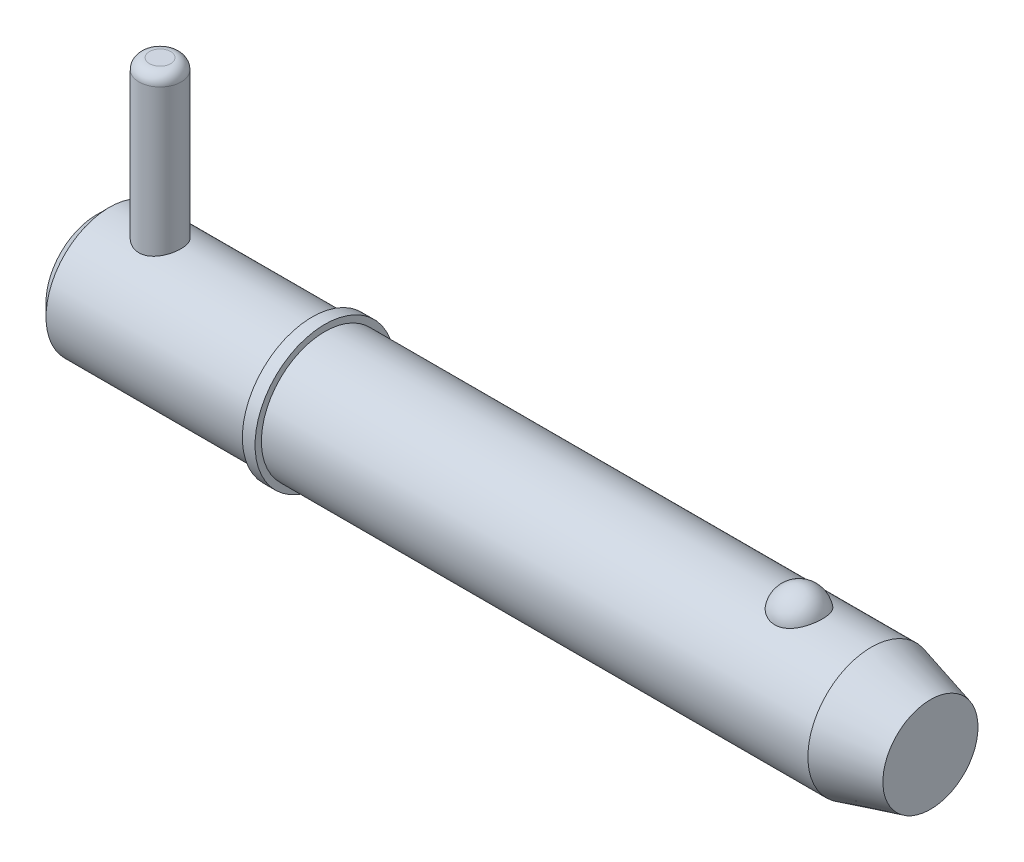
ISO-10303-21;
HEADER;
FILE_DESCRIPTION(('STEP AP214'),'2;1');
FILE_NAME('part.step','',(''),(''),'','','');
FILE_SCHEMA(('AUTOMOTIVE_DESIGN { 1 0 10303 214 1 1 1 1 }'));
ENDSEC;
DATA;
#1=APPLICATION_CONTEXT('core data for automotive mechanical design processes');
#2=APPLICATION_PROTOCOL_DEFINITION('international standard','automotive_design',2000,#1);
#3=PRODUCT_CONTEXT('',#1,'mechanical');
#4=PRODUCT('Part','Part','',(#3));
#5=PRODUCT_RELATED_PRODUCT_CATEGORY('part','',(#4));
#6=PRODUCT_DEFINITION_FORMATION('','',#4);
#7=PRODUCT_DEFINITION_CONTEXT('part definition',#1,'design');
#8=PRODUCT_DEFINITION('design','',#6,#7);
#9=PRODUCT_DEFINITION_SHAPE('','',#8);
#10=(LENGTH_UNIT() NAMED_UNIT(*) SI_UNIT(.MILLI.,.METRE.));
#11=(NAMED_UNIT(*) PLANE_ANGLE_UNIT() SI_UNIT($,.RADIAN.));
#12=(NAMED_UNIT(*) SI_UNIT($,.STERADIAN.) SOLID_ANGLE_UNIT());
#13=UNCERTAINTY_MEASURE_WITH_UNIT(LENGTH_MEASURE(1.E-05),#10,'distance_accuracy_value','');
#14=(GEOMETRIC_REPRESENTATION_CONTEXT(3) GLOBAL_UNCERTAINTY_ASSIGNED_CONTEXT((#13)) GLOBAL_UNIT_ASSIGNED_CONTEXT((#10,
#11,#12)) REPRESENTATION_CONTEXT('',''));
#15=CARTESIAN_POINT('',(0.,0.,0.));
#16=DIRECTION('',(0.,0.,1.));
#17=DIRECTION('',(1.,0.,0.));
#18=AXIS2_PLACEMENT_3D('',#15,#16,#17);
#19=CARTESIAN_POINT('',(7.14,24.605,0.));
#20=DIRECTION('',(0.,-1.,0.));
#21=DIRECTION('',(0.,0.,-1.));
#22=AXIS2_PLACEMENT_3D('',#19,#20,#21);
#23=CYLINDRICAL_SURFACE('',#22,2.38);
#24=CARTESIAN_POINT('',(7.14,-5.955,0.));
#25=DIRECTION('',(0.,1.,0.));
#26=DIRECTION('',(0.,0.,1.));
#27=AXIS2_PLACEMENT_3D('',#24,#25,#26);
#28=CIRCLE('',#27,2.38);
#29=CARTESIAN_POINT('',(7.14,-5.955,2.38));
#30=VERTEX_POINT('',#29);
#31=EDGE_CURVE('P0_E25',#30,#30,#28,.T.);
#32=ORIENTED_EDGE('',*,*,#31,.T.);
#33=EDGE_LOOP('',(#32));
#34=FACE_BOUND('',#33,.T.);
#35=CARTESIAN_POINT('',(7.14,23.415,0.));
#36=DIRECTION('',(0.,1.,0.));
#37=DIRECTION('',(0.,0.,1.));
#38=AXIS2_PLACEMENT_3D('',#35,#36,#37);
#39=CIRCLE('',#38,2.38);
#40=CARTESIAN_POINT('',(7.14,23.415,2.38));
#41=VERTEX_POINT('',#40);
#42=EDGE_CURVE('P0_E29',#41,#41,#39,.F.);
#43=ORIENTED_EDGE('',*,*,#42,.T.);
#44=EDGE_LOOP('',(#43));
#45=FACE_BOUND('',#44,.T.);
#46=ADVANCED_FACE('P0_F14',(#34,#45),#23,.T.);
#47=CARTESIAN_POINT('',(7.14,24.605,0.));
#48=DIRECTION('',(0.,1.,0.));
#49=DIRECTION('',(0.,0.,1.));
#50=AXIS2_PLACEMENT_3D('',#47,#48,#49);
#51=PLANE('',#50);
#52=CARTESIAN_POINT('',(7.14,24.605,0.));
#53=DIRECTION('',(0.,1.,0.));
#54=DIRECTION('',(0.,0.,1.));
#55=AXIS2_PLACEMENT_3D('',#52,#53,#54);
#56=CIRCLE('',#55,1.19);
#57=CARTESIAN_POINT('',(7.14,24.605,1.19));
#58=VERTEX_POINT('',#57);
#59=EDGE_CURVE('P0_E10',#58,#58,#56,.T.);
#60=ORIENTED_EDGE('',*,*,#59,.T.);
#61=EDGE_LOOP('',(#60));
#62=FACE_BOUND('',#61,.T.);
#63=ADVANCED_FACE('P0_F46',(#62),#51,.T.);
#64=CARTESIAN_POINT('',(7.14,-7.145,0.));
#65=DIRECTION('',(0.,1.,0.));
#66=DIRECTION('',(0.,0.,1.));
#67=AXIS2_PLACEMENT_3D('',#64,#65,#66);
#68=PLANE('',#67);
#69=CARTESIAN_POINT('',(7.14,-7.145,0.));
#70=DIRECTION('',(0.,1.,0.));
#71=DIRECTION('',(0.,0.,1.));
#72=AXIS2_PLACEMENT_3D('',#69,#70,#71);
#73=CIRCLE('',#72,1.19);
#74=CARTESIAN_POINT('',(7.14,-7.145,1.19));
#75=VERTEX_POINT('',#74);
#76=EDGE_CURVE('P0_E21',#75,#75,#73,.F.);
#77=ORIENTED_EDGE('',*,*,#76,.T.);
#78=EDGE_LOOP('',(#77));
#79=FACE_BOUND('',#78,.T.);
#80=ADVANCED_FACE('P0_F43',(#79),#68,.F.);
#81=CARTESIAN_POINT('',(7.14,-5.955,0.));
#82=DIRECTION('',(0.,1.,0.));
#83=DIRECTION('',(0.,0.,1.));
#84=AXIS2_PLACEMENT_3D('',#81,#82,#83);
#85=DEGENERATE_TOROIDAL_SURFACE('',#84,1.19,1.19,.T.);
#86=ORIENTED_EDGE('',*,*,#76,.F.);
#87=EDGE_LOOP('',(#86));
#88=FACE_BOUND('',#87,.T.);
#89=ORIENTED_EDGE('',*,*,#31,.F.);
#90=EDGE_LOOP('',(#89));
#91=FACE_BOUND('',#90,.T.);
#92=ADVANCED_FACE('P0_F38',(#88,#91),#85,.T.);
#93=CARTESIAN_POINT('',(7.14,23.415,0.));
#94=DIRECTION('',(0.,1.,0.));
#95=DIRECTION('',(0.,0.,1.));
#96=AXIS2_PLACEMENT_3D('',#93,#94,#95);
#97=DEGENERATE_TOROIDAL_SURFACE('',#96,1.19,1.19,.T.);
#98=ORIENTED_EDGE('',*,*,#42,.F.);
#99=EDGE_LOOP('',(#98));
#100=FACE_BOUND('',#99,.T.);
#101=ORIENTED_EDGE('',*,*,#59,.F.);
#102=EDGE_LOOP('',(#101));
#103=FACE_BOUND('',#102,.T.);
#104=ADVANCED_FACE('P0_F16',(#100,#103),#97,.T.);
#105=CLOSED_SHELL('',(#46,#63,#80,#92,#104));
#106=MANIFOLD_SOLID_BREP('P0_B1',#105);
#107=CARTESIAN_POINT('',(0.,0.,0.));
#108=DIRECTION('',(1.,0.,0.));
#109=DIRECTION('',(0.,0.,-1.));
#110=AXIS2_PLACEMENT_3D('',#107,#108,#109);
#111=CYLINDRICAL_SURFACE('',#110,7.145);
#112=CARTESIAN_POINT('',(87.2836242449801,0.,0.));
#113=DIRECTION('',(1.,0.,0.));
#114=DIRECTION('',(0.,0.,-1.));
#115=AXIS2_PLACEMENT_3D('',#112,#113,#114);
#116=CIRCLE('',#115,7.145);
#117=CARTESIAN_POINT('',(87.2836242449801,0.,-7.145));
#118=VERTEX_POINT('',#117);
#119=EDGE_CURVE('P1_E81',#118,#118,#116,.T.);
#120=ORIENTED_EDGE('',*,*,#119,.F.);
#121=EDGE_LOOP('',(#120));
#122=FACE_BOUND('',#121,.T.);
#123=CARTESIAN_POINT('',(25.7,0.,0.));
#124=DIRECTION('',(1.,0.,0.));
#125=DIRECTION('',(0.,0.,-1.));
#126=AXIS2_PLACEMENT_3D('',#123,#124,#125);
#127=CIRCLE('',#126,7.145);
#128=CARTESIAN_POINT('',(25.7,0.,-7.145));
#129=VERTEX_POINT('',#128);
#130=EDGE_CURVE('P1_E85',#129,#129,#127,.T.);
#131=ORIENTED_EDGE('',*,*,#130,.T.);
#132=EDGE_LOOP('',(#131));
#133=FACE_BOUND('',#132,.T.);
#134=CARTESIAN_POINT('',(79.1395037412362,6.60328629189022,2.72903557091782));
#135=CARTESIAN_POINT('',(78.998315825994,6.60329644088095,2.72902496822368));
#136=CARTESIAN_POINT('',(78.8568832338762,6.60799490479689,2.71772840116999));
#137=CARTESIAN_POINT('',(78.5779557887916,6.62628236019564,2.67281935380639));
#138=CARTESIAN_POINT('',(78.4404726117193,6.63989534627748,2.63914664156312));
#139=CARTESIAN_POINT('',(78.1738894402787,6.67440775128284,2.55059642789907));
#140=CARTESIAN_POINT('',(78.0447683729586,6.69528793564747,2.49577486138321));
#141=CARTESIAN_POINT('',(77.7978694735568,6.74205585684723,2.36651799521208));
#142=CARTESIAN_POINT('',(77.6800865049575,6.76794130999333,2.29209163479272));
#143=CARTESIAN_POINT('',(77.4551671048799,6.82286177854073,2.12312937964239));
#144=CARTESIAN_POINT('',(77.3484405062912,6.85196655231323,2.02807107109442));
#145=CARTESIAN_POINT('',(77.1519181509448,6.90970232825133,1.82167822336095));
#146=CARTESIAN_POINT('',(77.0621276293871,6.93833318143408,1.71033867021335));
#147=CARTESIAN_POINT('',(76.8976670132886,6.9935167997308,1.46891951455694));
#148=CARTESIAN_POINT('',(76.823844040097,7.01992110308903,1.33822781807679));
#149=CARTESIAN_POINT('',(76.6980884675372,7.06643385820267,1.0656656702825));
#150=CARTESIAN_POINT('',(76.6461573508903,7.08654188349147,0.923794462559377));
#151=CARTESIAN_POINT('',(76.5647323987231,7.11862399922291,0.630993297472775));
#152=CARTESIAN_POINT('',(76.5355167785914,7.13049704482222,0.479974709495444));
#153=CARTESIAN_POINT('',(76.5011742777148,7.14449484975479,0.174782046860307));
#154=CARTESIAN_POINT('',(76.4960466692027,7.14661990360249,0.0206080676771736));
#155=CARTESIAN_POINT('',(76.509938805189,7.14092465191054,-0.285506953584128));
#156=CARTESIAN_POINT('',(76.5288101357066,7.1331654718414,-0.437455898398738));
#157=CARTESIAN_POINT('',(76.5900622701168,7.10859076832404,-0.73577860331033));
#158=CARTESIAN_POINT('',(76.6324435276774,7.0917750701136,-0.882152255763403));
#159=CARTESIAN_POINT('',(76.7399346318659,7.05076716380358,-1.16543149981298));
#160=CARTESIAN_POINT('',(76.8050759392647,7.02656475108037,-1.30232366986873));
#161=CARTESIAN_POINT('',(76.9567597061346,6.97329145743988,-1.56265907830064));
#162=CARTESIAN_POINT('',(77.0433039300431,6.94422017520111,-1.68610120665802));
#163=CARTESIAN_POINT('',(77.2364654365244,6.88415108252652,-1.91671004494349));
#164=CARTESIAN_POINT('',(77.3431807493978,6.85314438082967,-2.02379244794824));
#165=CARTESIAN_POINT('',(77.5739740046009,6.79282069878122,-2.21787433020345));
#166=CARTESIAN_POINT('',(77.6980505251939,6.76350358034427,-2.30487545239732));
#167=CARTESIAN_POINT('',(77.9576784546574,6.7106058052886,-2.45458647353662));
#168=CARTESIAN_POINT('',(78.0929387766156,6.68691885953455,-2.5177624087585));
#169=CARTESIAN_POINT('',(78.3732778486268,6.64741247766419,-2.62030218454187));
#170=CARTESIAN_POINT('',(78.518352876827,6.63159007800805,-2.65967499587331));
#171=CARTESIAN_POINT('',(78.8063475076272,6.61038594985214,-2.71193301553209));
#172=CARTESIAN_POINT('',(78.9490080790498,6.60451880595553,-2.72605165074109));
#173=CARTESIAN_POINT('',(79.2348004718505,6.60240611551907,-2.73116688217));
#174=CARTESIAN_POINT('',(79.3779321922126,6.60615862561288,-2.72216814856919));
#175=CARTESIAN_POINT('',(79.6558486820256,6.6225609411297,-2.68200435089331));
#176=CARTESIAN_POINT('',(79.7907542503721,6.63492533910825,-2.65154998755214));
#177=CARTESIAN_POINT('',(80.05332009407,6.66687445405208,-2.57015684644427));
#178=CARTESIAN_POINT('',(80.1809797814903,6.68645975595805,-2.51921640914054));
#179=CARTESIAN_POINT('',(80.4285777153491,6.73127274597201,-2.39693610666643));
#180=CARTESIAN_POINT('',(80.5482878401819,6.7566138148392,-2.32517694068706));
#181=CARTESIAN_POINT('',(80.7741592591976,6.8100600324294,-2.1636381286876));
#182=CARTESIAN_POINT('',(80.880317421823,6.83816581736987,-2.07385432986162));
#183=CARTESIAN_POINT('',(81.0818620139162,6.89580469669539,-1.87357235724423));
#184=CARTESIAN_POINT('',(81.176440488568,6.92533863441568,-1.76226074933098));
#185=CARTESIAN_POINT('',(81.3463329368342,6.98139526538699,-1.52511696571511));
#186=CARTESIAN_POINT('',(81.4216434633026,7.0079174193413,-1.39928219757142));
#187=CARTESIAN_POINT('',(81.553595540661,7.05607625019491,-1.1321597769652));
#188=CARTESIAN_POINT('',(81.6095688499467,7.07753119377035,-0.990508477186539));
#189=CARTESIAN_POINT('',(81.6982965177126,7.11222355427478,-0.699154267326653));
#190=CARTESIAN_POINT('',(81.7310506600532,7.12546089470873,-0.549451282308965));
#191=CARTESIAN_POINT('',(81.7726899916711,7.1423758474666,-0.246120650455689));
#192=CARTESIAN_POINT('',(81.781558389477,7.14604673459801,-0.0924903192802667));
#193=CARTESIAN_POINT('',(81.7751940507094,7.14343510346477,0.214181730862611));
#194=CARTESIAN_POINT('',(81.7599618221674,7.13715279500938,0.367223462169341));
#195=CARTESIAN_POINT('',(81.7058451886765,7.11532948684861,0.667595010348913));
#196=CARTESIAN_POINT('',(81.6670776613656,7.09983424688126,0.814949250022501));
#197=CARTESIAN_POINT('',(81.5667700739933,7.06119140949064,1.10063221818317));
#198=CARTESIAN_POINT('',(81.5052284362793,7.03804328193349,1.23896032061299));
#199=CARTESIAN_POINT('',(81.3602071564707,6.98632429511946,1.5035230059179));
#200=CARTESIAN_POINT('',(81.2766067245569,6.95772382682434,1.62968561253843));
#201=CARTESIAN_POINT('',(81.0893804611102,6.89823072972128,1.865543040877));
#202=CARTESIAN_POINT('',(80.9857557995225,6.86733823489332,1.9752388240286));
#203=CARTESIAN_POINT('',(80.7610769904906,6.80676456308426,2.17482293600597));
#204=CARTESIAN_POINT('',(80.6400673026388,6.77708053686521,2.26476035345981));
#205=CARTESIAN_POINT('',(80.3833408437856,6.7223050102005,2.42252989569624));
#206=CARTESIAN_POINT('',(80.2476185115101,6.69721525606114,2.49035362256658));
#207=CARTESIAN_POINT('',(79.9704022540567,6.65552591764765,2.59967646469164));
#208=CARTESIAN_POINT('',(79.8292810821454,6.63865794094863,2.64202017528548));
#209=CARTESIAN_POINT('',(79.5414448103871,6.61425039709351,2.70255841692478));
#210=CARTESIAN_POINT('',(79.3947480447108,6.60668259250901,2.720826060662));
#211=CARTESIAN_POINT('',(79.2116799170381,6.60358754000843,2.72830331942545));
#212=CARTESIAN_POINT('',(79.1755998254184,6.60328369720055,2.72903828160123));
#213=CARTESIAN_POINT('',(79.1395037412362,6.60328629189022,2.72903557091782));
#214=B_SPLINE_CURVE_WITH_KNOTS('',3,(#134,#135,#136,#137,#138,#139,#140,#141,#142,#143,#144,
#145,#146,#147,#148,#149,#150,#151,#152,#153,#154,#155,#156,#157,#158,#159,#160,#161,#162,#163,
#164,#165,#166,#167,#168,#169,#170,#171,#172,#173,#174,#175,#176,#177,#178,#179,#180,#181,#182,
#183,#184,#185,#186,#187,#188,#189,#190,#191,#192,#193,#194,#195,#196,#197,#198,#199,#200,#201,
#202,#203,#204,#205,#206,#207,#208,#209,#210,#211,#212,#213),.UNSPECIFIED.,.T.,.F.,(4,2,2,2,2,2,
2,2,2,2,2,2,2,2,2,2,2,2,2,2,2,2,2,2,2,2,2,2,2,2,2,2,2,2,2,2,2,2,2,4),(0.,0.423468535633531,
0.848081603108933,1.27157926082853,1.69488414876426,2.13051395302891,2.56627819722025,
3.0213670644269,3.47648674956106,3.93709649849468,4.39769233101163,4.85545355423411,
5.31322361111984,5.77162895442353,6.23007210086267,6.69080337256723,7.15149693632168,
7.60264329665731,8.05361952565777,8.48189729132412,8.91008854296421,9.32472524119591,
9.73939553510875,10.1630783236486,10.5868588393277,11.0319070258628,11.4770347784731,
11.9362874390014,12.3955443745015,12.855124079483,13.3146940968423,13.7720003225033,
14.2293382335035,14.6892343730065,15.1491036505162,15.6078171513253,16.0667046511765,
16.5093965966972,16.9507410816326,17.059004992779),.UNSPECIFIED.);
#215=CARTESIAN_POINT('',(79.1395037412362,6.60328629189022,2.72903557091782));
#216=VERTEX_POINT('',#215);
#217=EDGE_CURVE('P1_E35',#216,#216,#214,.T.);
#218=ORIENTED_EDGE('',*,*,#217,.T.);
#219=EDGE_LOOP('',(#218));
#220=FACE_BOUND('',#219,.T.);
#221=ADVANCED_FACE('P1_F13',(#122,#133,#220),#111,.T.);
#222=CARTESIAN_POINT('',(0.,0.,0.));
#223=DIRECTION('',(-1.,0.,0.));
#224=DIRECTION('',(0.,0.,1.));
#225=AXIS2_PLACEMENT_3D('',#222,#223,#224);
#226=PLANE('',#225);
#227=CARTESIAN_POINT('',(0.,0.,0.));
#228=DIRECTION('',(1.,0.,0.));
#229=DIRECTION('',(0.,0.,-1.));
#230=AXIS2_PLACEMENT_3D('',#227,#228,#229);
#231=CIRCLE('',#230,5.716);
#232=CARTESIAN_POINT('',(0.,0.,-5.716));
#233=VERTEX_POINT('',#232);
#234=EDGE_CURVE('P1_E9',#233,#233,#231,.T.);
#235=ORIENTED_EDGE('',*,*,#234,.F.);
#236=EDGE_LOOP('',(#235));
#237=FACE_BOUND('',#236,.T.);
#238=ADVANCED_FACE('P1_F15',(#237),#226,.T.);
#239=CARTESIAN_POINT('',(1.42899999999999,0.,0.));
#240=DIRECTION('',(1.,0.,0.));
#241=DIRECTION('',(0.,0.,-1.));
#242=AXIS2_PLACEMENT_3D('',#239,#240,#241);
#243=CONICAL_SURFACE('',#242,7.145,0.78539816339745);
#244=ORIENTED_EDGE('',*,*,#234,.T.);
#245=EDGE_LOOP('',(#244));
#246=FACE_BOUND('',#245,.T.);
#247=CARTESIAN_POINT('',(1.42899999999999,0.,0.));
#248=DIRECTION('',(1.,0.,0.));
#249=DIRECTION('',(0.,0.,-1.));
#250=AXIS2_PLACEMENT_3D('',#247,#248,#249);
#251=CIRCLE('',#250,7.145);
#252=CARTESIAN_POINT('',(1.42899999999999,0.,-7.145));
#253=VERTEX_POINT('',#252);
#254=EDGE_CURVE('P1_E26',#253,#253,#251,.T.);
#255=ORIENTED_EDGE('',*,*,#254,.F.);
#256=EDGE_LOOP('',(#255));
#257=FACE_BOUND('',#256,.T.);
#258=ADVANCED_FACE('P1_F77',(#246,#257),#243,.T.);
#259=CARTESIAN_POINT('',(0.,0.,0.));
#260=DIRECTION('',(1.,0.,0.));
#261=DIRECTION('',(0.,0.,-1.));
#262=AXIS2_PLACEMENT_3D('',#259,#260,#261);
#263=CYLINDRICAL_SURFACE('',#262,7.145);
#264=CARTESIAN_POINT('',(7.14,-6.73695962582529,2.38));
#265=CARTESIAN_POINT('',(7.01035997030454,-6.73695921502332,2.38000059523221));
#266=CARTESIAN_POINT('',(6.88072348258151,-6.74074253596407,2.36937183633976));
#267=CARTESIAN_POINT('',(6.62529075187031,-6.75538853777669,2.32728080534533));
#268=CARTESIAN_POINT('',(6.49949514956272,-6.76625239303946,2.29581507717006));
#269=CARTESIAN_POINT('',(6.2554858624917,-6.79369535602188,2.21327763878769));
#270=CARTESIAN_POINT('',(6.13725786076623,-6.81026326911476,2.16224430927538));
#271=CARTESIAN_POINT('',(5.91100349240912,-6.84723128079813,2.04215132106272));
#272=CARTESIAN_POINT('',(5.80297937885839,-6.86763222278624,1.97308769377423));
#273=CARTESIAN_POINT('',(5.59597854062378,-6.91086152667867,1.81600414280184));
#274=CARTESIAN_POINT('',(5.49745861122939,-6.93375032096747,1.72739874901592));
#275=CARTESIAN_POINT('',(5.31636508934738,-6.97886546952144,1.53499636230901));
#276=CARTESIAN_POINT('',(5.23379405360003,-7.00109171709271,1.43119693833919));
#277=CARTESIAN_POINT('',(5.08487013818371,-7.04307708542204,1.20801318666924));
#278=CARTESIAN_POINT('',(5.01899578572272,-7.06275685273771,1.08829330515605));
#279=CARTESIAN_POINT('',(4.90850130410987,-7.09671988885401,0.838703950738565));
#280=CARTESIAN_POINT('',(4.86387545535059,-7.11100460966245,0.70883722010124));
#281=CARTESIAN_POINT('',(4.79869354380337,-7.13213998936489,0.44742990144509));
#282=CARTESIAN_POINT('',(4.77735497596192,-7.13923172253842,0.316104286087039));
#283=CARTESIAN_POINT('',(4.75686536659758,-7.14603777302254,0.0515578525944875));
#284=CARTESIAN_POINT('',(4.75770861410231,-7.14575398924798,-0.0816624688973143));
#285=CARTESIAN_POINT('',(4.78106216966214,-7.13800438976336,-0.340678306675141));
#286=CARTESIAN_POINT('',(4.80272255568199,-7.13082030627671,-0.466560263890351));
#287=CARTESIAN_POINT('',(4.86569013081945,-7.11043095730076,-0.712788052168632));
#288=CARTESIAN_POINT('',(4.90699865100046,-7.09722528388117,-0.833133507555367));
#289=CARTESIAN_POINT('',(5.00858673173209,-7.06591754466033,-1.06673173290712));
#290=CARTESIAN_POINT('',(5.06910834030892,-7.0477534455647,-1.17987058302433));
#291=CARTESIAN_POINT('',(5.20720514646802,-7.00841977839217,-1.39463797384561));
#292=CARTESIAN_POINT('',(5.28478508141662,-6.987249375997,-1.49626330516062));
#293=CARTESIAN_POINT('',(5.4590800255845,-6.94296010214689,-1.69017445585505));
#294=CARTESIAN_POINT('',(5.55652324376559,-6.91979641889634,-1.78179645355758));
#295=CARTESIAN_POINT('',(5.76558873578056,-6.87497076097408,-1.94761348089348));
#296=CARTESIAN_POINT('',(5.87721318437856,-6.85330901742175,-2.02180583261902));
#297=CARTESIAN_POINT('',(6.11357367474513,-6.81369485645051,-2.15157488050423));
#298=CARTESIAN_POINT('',(6.23847358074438,-6.79579956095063,-2.20687188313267));
#299=CARTESIAN_POINT('',(6.49655785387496,-6.76640630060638,-2.29542443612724));
#300=CARTESIAN_POINT('',(6.62973872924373,-6.75490565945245,-2.32868920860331));
#301=CARTESIAN_POINT('',(6.89417536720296,-6.74020933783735,-2.37088225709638));
#302=CARTESIAN_POINT('',(7.02524746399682,-6.73666278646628,-2.38083959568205));
#303=CARTESIAN_POINT('',(7.28721035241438,-6.73729555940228,-2.37904974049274));
#304=CARTESIAN_POINT('',(7.41810117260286,-6.7414734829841,-2.36730648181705));
#305=CARTESIAN_POINT('',(7.67130717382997,-6.75673471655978,-2.32337336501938));
#306=CARTESIAN_POINT('',(7.79376251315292,-6.76757635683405,-2.29189834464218));
#307=CARTESIAN_POINT('',(8.03162917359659,-6.79467771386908,-2.21025275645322));
#308=CARTESIAN_POINT('',(8.14703924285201,-6.8109383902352,-2.16007887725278));
#309=CARTESIAN_POINT('',(8.37159169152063,-6.84768362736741,-2.04065289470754));
#310=CARTESIAN_POINT('',(8.48041962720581,-6.86828569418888,-1.97084668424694));
#311=CARTESIAN_POINT('',(8.68518919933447,-6.91116416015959,-1.8147657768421));
#312=CARTESIAN_POINT('',(8.78112702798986,-6.93344105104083,-1.72848623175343));
#313=CARTESIAN_POINT('',(8.96215574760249,-6.97845348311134,-1.53698616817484));
#314=CARTESIAN_POINT('',(9.04650427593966,-7.00115965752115,-1.43105491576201));
#315=CARTESIAN_POINT('',(9.19627592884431,-7.04341676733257,-1.20598377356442));
#316=CARTESIAN_POINT('',(9.26169972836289,-7.06296781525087,-1.08684435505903));
#317=CARTESIAN_POINT('',(9.37116617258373,-7.0966205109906,-0.83933303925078));
#318=CARTESIAN_POINT('',(9.41534821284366,-7.11075755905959,-0.711027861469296));
#319=CARTESIAN_POINT('',(9.48132660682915,-7.13214194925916,-0.448245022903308));
#320=CARTESIAN_POINT('',(9.50313102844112,-7.13939177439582,-0.313769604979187));
#321=CARTESIAN_POINT('',(9.5230098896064,-7.14599771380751,-0.049254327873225));
#322=CARTESIAN_POINT('',(9.52215013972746,-7.14570837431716,0.0806974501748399));
#323=CARTESIAN_POINT('',(9.49935359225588,-7.13814116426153,0.338518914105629));
#324=CARTESIAN_POINT('',(9.47741850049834,-7.13086385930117,0.466388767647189));
#325=CARTESIAN_POINT('',(9.4138005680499,-7.11026814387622,0.714400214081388));
#326=CARTESIAN_POINT('',(9.37243609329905,-7.09704726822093,0.834632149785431));
#327=CARTESIAN_POINT('',(9.27142829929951,-7.06592602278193,1.06649582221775));
#328=CARTESIAN_POINT('',(9.2117816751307,-7.04802480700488,1.1781259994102));
#329=CARTESIAN_POINT('',(9.07336776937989,-7.00856499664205,1.39411030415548));
#330=CARTESIAN_POINT('',(8.99397590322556,-6.98689577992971,1.49804368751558));
#331=CARTESIAN_POINT('',(8.81938810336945,-6.9426110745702,1.69146078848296));
#332=CARTESIAN_POINT('',(8.72418713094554,-6.91999528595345,1.78093988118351));
#333=CARTESIAN_POINT('',(8.51623540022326,-6.87531507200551,1.94646188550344));
#334=CARTESIAN_POINT('',(8.4029442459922,-6.85330672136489,2.02184316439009));
#335=CARTESIAN_POINT('',(8.16461714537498,-6.81342065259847,2.1524427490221));
#336=CARTESIAN_POINT('',(8.03958429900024,-6.7955418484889,2.20766635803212));
#337=CARTESIAN_POINT('',(7.78712566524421,-6.76686117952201,2.29403636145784));
#338=CARTESIAN_POINT('',(7.66006989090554,-6.75577342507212,2.32616709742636));
#339=CARTESIAN_POINT('',(7.40200728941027,-6.74082409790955,2.36914495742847));
#340=CARTESIAN_POINT('',(7.27100183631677,-6.73696004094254,2.37999939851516));
#341=CARTESIAN_POINT('',(7.14,-6.73695962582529,2.38));
#342=B_SPLINE_CURVE_WITH_KNOTS('',3,(#264,#265,#266,#267,#268,#269,#270,#271,#272,#273,#274,
#275,#276,#277,#278,#279,#280,#281,#282,#283,#284,#285,#286,#287,#288,#289,#290,#291,#292,#293,
#294,#295,#296,#297,#298,#299,#300,#301,#302,#303,#304,#305,#306,#307,#308,#309,#310,#311,#312,
#313,#314,#315,#316,#317,#318,#319,#320,#321,#322,#323,#324,#325,#326,#327,#328,#329,#330,#331,
#332,#333,#334,#335,#336,#337,#338,#339,#340,#341),.UNSPECIFIED.,.T.,.F.,(4,2,2,2,2,2,2,2,2,2,2,
2,2,2,2,2,2,2,2,2,2,2,2,2,2,2,2,2,2,2,2,2,2,2,2,2,2,2,4),(0.,0.388434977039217,
0.776934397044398,1.16467566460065,1.55250234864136,1.9540847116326,2.35573139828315,
2.76784120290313,3.17984001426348,3.57752248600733,3.97510257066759,4.35711073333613,
4.7391447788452,5.12619663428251,5.51335611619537,5.91871976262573,6.3241456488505,
6.73533623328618,7.14635459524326,7.53885245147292,7.93127914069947,8.31025106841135,
8.68929014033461,9.08033871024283,9.47150254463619,9.88145528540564,10.2913934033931,
10.6986033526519,11.1056664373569,11.4936225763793,11.8815473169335,12.2633262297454,
12.645174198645,13.0411187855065,13.437189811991,13.8487371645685,14.2601761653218,
14.6528265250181,15.0453418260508),.UNSPECIFIED.);
#343=CARTESIAN_POINT('',(7.14,-6.73695962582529,2.38));
#344=VERTEX_POINT('',#343);
#345=EDGE_CURVE('P1_E17',#344,#344,#342,.T.);
#346=ORIENTED_EDGE('',*,*,#345,.F.);
#347=EDGE_LOOP('',(#346));
#348=FACE_BOUND('',#347,.T.);
#349=CARTESIAN_POINT('',(7.14,6.73695962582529,2.38));
#350=CARTESIAN_POINT('',(7.26964002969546,6.73695921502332,2.38000059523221));
#351=CARTESIAN_POINT('',(7.39927651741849,6.74074253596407,2.36937183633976));
#352=CARTESIAN_POINT('',(7.65470924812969,6.75538853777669,2.32728080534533));
#353=CARTESIAN_POINT('',(7.78050485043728,6.76625239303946,2.29581507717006));
#354=CARTESIAN_POINT('',(8.02451413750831,6.79369535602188,2.21327763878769));
#355=CARTESIAN_POINT('',(8.14274213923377,6.81026326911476,2.16224430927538));
#356=CARTESIAN_POINT('',(8.36899650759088,6.84723128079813,2.04215132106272));
#357=CARTESIAN_POINT('',(8.47702062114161,6.86763222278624,1.97308769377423));
#358=CARTESIAN_POINT('',(8.68402145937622,6.91086152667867,1.81600414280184));
#359=CARTESIAN_POINT('',(8.78254138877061,6.93375032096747,1.72739874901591));
#360=CARTESIAN_POINT('',(8.96363491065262,6.97886546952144,1.53499636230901));
#361=CARTESIAN_POINT('',(9.04620594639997,7.00109171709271,1.43119693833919));
#362=CARTESIAN_POINT('',(9.19512986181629,7.04307708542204,1.20801318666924));
#363=CARTESIAN_POINT('',(9.26100421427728,7.06275685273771,1.08829330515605));
#364=CARTESIAN_POINT('',(9.37149869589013,7.09671988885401,0.838703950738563));
#365=CARTESIAN_POINT('',(9.41612454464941,7.11100460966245,0.708837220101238));
#366=CARTESIAN_POINT('',(9.48130645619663,7.13213998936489,0.447429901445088));
#367=CARTESIAN_POINT('',(9.50264502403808,7.13923172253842,0.316104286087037));
#368=CARTESIAN_POINT('',(9.52313463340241,7.14603777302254,0.0515578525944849));
#369=CARTESIAN_POINT('',(9.52229138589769,7.14575398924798,-0.0816624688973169));
#370=CARTESIAN_POINT('',(9.49893783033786,7.13800438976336,-0.340678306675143));
#371=CARTESIAN_POINT('',(9.47727744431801,7.13082030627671,-0.466560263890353));
#372=CARTESIAN_POINT('',(9.41430986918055,7.11043095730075,-0.712788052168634));
#373=CARTESIAN_POINT('',(9.37300134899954,7.09722528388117,-0.833133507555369));
#374=CARTESIAN_POINT('',(9.27141326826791,7.06591754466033,-1.06673173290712));
#375=CARTESIAN_POINT('',(9.21089165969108,7.0477534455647,-1.17987058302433));
#376=CARTESIAN_POINT('',(9.07279485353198,7.00841977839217,-1.39463797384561));
#377=CARTESIAN_POINT('',(8.99521491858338,6.987249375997,-1.49626330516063));
#378=CARTESIAN_POINT('',(8.82091997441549,6.94296010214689,-1.69017445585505));
#379=CARTESIAN_POINT('',(8.72347675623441,6.91979641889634,-1.78179645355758));
#380=CARTESIAN_POINT('',(8.51441126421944,6.87497076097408,-1.94761348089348));
#381=CARTESIAN_POINT('',(8.40278681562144,6.85330901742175,-2.02180583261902));
#382=CARTESIAN_POINT('',(8.16642632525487,6.81369485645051,-2.15157488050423));
#383=CARTESIAN_POINT('',(8.04152641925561,6.79579956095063,-2.20687188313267));
#384=CARTESIAN_POINT('',(7.78344214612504,6.76640630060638,-2.29542443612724));
#385=CARTESIAN_POINT('',(7.65026127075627,6.75490565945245,-2.32868920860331));
#386=CARTESIAN_POINT('',(7.38582463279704,6.74020933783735,-2.37088225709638));
#387=CARTESIAN_POINT('',(7.25475253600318,6.73666278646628,-2.38083959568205));
#388=CARTESIAN_POINT('',(6.99278964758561,6.73729555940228,-2.37904974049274));
#389=CARTESIAN_POINT('',(6.86189882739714,6.7414734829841,-2.36730648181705));
#390=CARTESIAN_POINT('',(6.60869282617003,6.75673471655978,-2.32337336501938));
#391=CARTESIAN_POINT('',(6.48623748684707,6.76757635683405,-2.29189834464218));
#392=CARTESIAN_POINT('',(6.2483708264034,6.79467771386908,-2.21025275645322));
#393=CARTESIAN_POINT('',(6.13296075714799,6.8109383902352,-2.16007887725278));
#394=CARTESIAN_POINT('',(5.90840830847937,6.84768362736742,-2.04065289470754));
#395=CARTESIAN_POINT('',(5.79958037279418,6.86828569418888,-1.97084668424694));
#396=CARTESIAN_POINT('',(5.59481080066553,6.91116416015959,-1.8147657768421));
#397=CARTESIAN_POINT('',(5.49887297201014,6.93344105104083,-1.72848623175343));
#398=CARTESIAN_POINT('',(5.31784425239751,6.97845348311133,-1.53698616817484));
#399=CARTESIAN_POINT('',(5.23349572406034,7.00115965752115,-1.43105491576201));
#400=CARTESIAN_POINT('',(5.08372407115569,7.04341676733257,-1.20598377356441));
#401=CARTESIAN_POINT('',(5.01830027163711,7.06296781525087,-1.08684435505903));
#402=CARTESIAN_POINT('',(4.90883382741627,7.0966205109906,-0.839333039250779));
#403=CARTESIAN_POINT('',(4.86465178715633,7.11075755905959,-0.711027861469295));
#404=CARTESIAN_POINT('',(4.79867339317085,7.13214194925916,-0.448245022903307));
#405=CARTESIAN_POINT('',(4.77686897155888,7.13939177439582,-0.313769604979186));
#406=CARTESIAN_POINT('',(4.7569901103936,7.14599771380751,-0.0492543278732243));
#407=CARTESIAN_POINT('',(4.75784986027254,7.14570837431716,0.0806974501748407));
#408=CARTESIAN_POINT('',(4.78064640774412,7.13814116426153,0.33851891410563));
#409=CARTESIAN_POINT('',(4.80258149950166,7.13086385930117,0.46638876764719));
#410=CARTESIAN_POINT('',(4.8661994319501,7.11026814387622,0.714400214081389));
#411=CARTESIAN_POINT('',(4.90756390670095,7.09704726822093,0.834632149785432));
#412=CARTESIAN_POINT('',(5.00857170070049,7.06592602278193,1.06649582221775));
#413=CARTESIAN_POINT('',(5.0682183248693,7.04802480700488,1.1781259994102));
#414=CARTESIAN_POINT('',(5.20663223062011,7.00856499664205,1.39411030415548));
#415=CARTESIAN_POINT('',(5.28602409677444,6.98689577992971,1.49804368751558));
#416=CARTESIAN_POINT('',(5.46061189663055,6.9426110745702,1.69146078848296));
#417=CARTESIAN_POINT('',(5.55581286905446,6.91999528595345,1.78093988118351));
#418=CARTESIAN_POINT('',(5.76376459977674,6.87531507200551,1.94646188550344));
#419=CARTESIAN_POINT('',(5.8770557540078,6.85330672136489,2.02184316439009));
#420=CARTESIAN_POINT('',(6.11538285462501,6.81342065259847,2.1524427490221));
#421=CARTESIAN_POINT('',(6.24041570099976,6.7955418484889,2.20766635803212));
#422=CARTESIAN_POINT('',(6.4928743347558,6.76686117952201,2.29403636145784));
#423=CARTESIAN_POINT('',(6.61993010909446,6.75577342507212,2.32616709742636));
#424=CARTESIAN_POINT('',(6.87799271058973,6.74082409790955,2.36914495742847));
#425=CARTESIAN_POINT('',(7.00899816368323,6.73696004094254,2.37999939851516));
#426=CARTESIAN_POINT('',(7.14,6.73695962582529,2.38));
#427=B_SPLINE_CURVE_WITH_KNOTS('',3,(#349,#350,#351,#352,#353,#354,#355,#356,#357,#358,#359,
#360,#361,#362,#363,#364,#365,#366,#367,#368,#369,#370,#371,#372,#373,#374,#375,#376,#377,#378,
#379,#380,#381,#382,#383,#384,#385,#386,#387,#388,#389,#390,#391,#392,#393,#394,#395,#396,#397,
#398,#399,#400,#401,#402,#403,#404,#405,#406,#407,#408,#409,#410,#411,#412,#413,#414,#415,#416,
#417,#418,#419,#420,#421,#422,#423,#424,#425,#426),.UNSPECIFIED.,.T.,.F.,(4,2,2,2,2,2,2,2,2,2,2,
2,2,2,2,2,2,2,2,2,2,2,2,2,2,2,2,2,2,2,2,2,2,2,2,2,2,2,4),(0.,0.388434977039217,
0.776934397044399,1.16467566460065,1.55250234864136,1.9540847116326,2.35573139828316,
2.76784120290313,3.17984001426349,3.57752248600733,3.97510257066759,4.35711073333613,
4.73914477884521,5.12619663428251,5.51335611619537,5.91871976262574,6.3241456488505,
6.73533623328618,7.14635459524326,7.53885245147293,7.93127914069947,8.31025106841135,
8.68929014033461,9.08033871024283,9.47150254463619,9.88145528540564,10.2913934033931,
10.6986033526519,11.1056664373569,11.4936225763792,11.8815473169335,12.2633262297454,
12.645174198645,13.0411187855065,13.437189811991,13.8487371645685,14.2601761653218,
14.6528265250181,15.0453418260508),.UNSPECIFIED.);
#428=CARTESIAN_POINT('',(7.14,6.73695962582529,2.38));
#429=VERTEX_POINT('',#428);
#430=EDGE_CURVE('P1_E43',#429,#429,#427,.T.);
#431=ORIENTED_EDGE('',*,*,#430,.F.);
#432=EDGE_LOOP('',(#431));
#433=FACE_BOUND('',#432,.T.);
#434=ORIENTED_EDGE('',*,*,#254,.T.);
#435=EDGE_LOOP('',(#434));
#436=FACE_BOUND('',#435,.T.);
#437=CARTESIAN_POINT('',(24.271,0.,0.));
#438=DIRECTION('',(1.,0.,0.));
#439=DIRECTION('',(0.,0.,-1.));
#440=AXIS2_PLACEMENT_3D('',#437,#438,#439);
#441=CIRCLE('',#440,7.145);
#442=CARTESIAN_POINT('',(24.271,0.,-7.145));
#443=VERTEX_POINT('',#442);
#444=EDGE_CURVE('P1_E31',#443,#443,#441,.T.);
#445=ORIENTED_EDGE('',*,*,#444,.F.);
#446=EDGE_LOOP('',(#445));
#447=FACE_BOUND('',#446,.T.);
#448=ADVANCED_FACE('P1_F103',(#348,#433,#436,#447),#263,.T.);
#449=CARTESIAN_POINT('',(24.271,7.145,0.));
#450=DIRECTION('',(-1.,0.,0.));
#451=DIRECTION('',(0.,0.,1.));
#452=AXIS2_PLACEMENT_3D('',#449,#450,#451);
#453=PLANE('',#452);
#454=ORIENTED_EDGE('',*,*,#444,.T.);
#455=EDGE_LOOP('',(#454));
#456=FACE_BOUND('',#455,.T.);
#457=CARTESIAN_POINT('',(24.271,0.,0.));
#458=DIRECTION('',(1.,0.,0.));
#459=DIRECTION('',(0.,0.,-1.));
#460=AXIS2_PLACEMENT_3D('',#457,#458,#459);
#461=CIRCLE('',#460,7.8595);
#462=CARTESIAN_POINT('',(24.271,0.,-7.8595));
#463=VERTEX_POINT('',#462);
#464=EDGE_CURVE('P1_E91',#463,#463,#461,.T.);
#465=ORIENTED_EDGE('',*,*,#464,.F.);
#466=EDGE_LOOP('',(#465));
#467=FACE_BOUND('',#466,.T.);
#468=ADVANCED_FACE('P1_F100',(#456,#467),#453,.T.);
#469=CARTESIAN_POINT('',(0.,0.,0.));
#470=DIRECTION('',(1.,0.,0.));
#471=DIRECTION('',(0.,0.,-1.));
#472=AXIS2_PLACEMENT_3D('',#469,#470,#471);
#473=CYLINDRICAL_SURFACE('',#472,7.8595);
#474=ORIENTED_EDGE('',*,*,#464,.T.);
#475=EDGE_LOOP('',(#474));
#476=FACE_BOUND('',#475,.T.);
#477=CARTESIAN_POINT('',(25.7,0.,0.));
#478=DIRECTION('',(1.,0.,0.));
#479=DIRECTION('',(0.,0.,-1.));
#480=AXIS2_PLACEMENT_3D('',#477,#478,#479);
#481=CIRCLE('',#480,7.8595);
#482=CARTESIAN_POINT('',(25.7,0.,-7.8595));
#483=VERTEX_POINT('',#482);
#484=EDGE_CURVE('P1_E88',#483,#483,#481,.T.);
#485=ORIENTED_EDGE('',*,*,#484,.F.);
#486=EDGE_LOOP('',(#485));
#487=FACE_BOUND('',#486,.T.);
#488=ADVANCED_FACE('P1_F68',(#476,#487),#473,.T.);
#489=CARTESIAN_POINT('',(25.7,7.8595,0.));
#490=DIRECTION('',(1.,0.,0.));
#491=DIRECTION('',(0.,0.,-1.));
#492=AXIS2_PLACEMENT_3D('',#489,#490,#491);
#493=PLANE('',#492);
#494=ORIENTED_EDGE('',*,*,#484,.T.);
#495=EDGE_LOOP('',(#494));
#496=FACE_BOUND('',#495,.T.);
#497=ORIENTED_EDGE('',*,*,#130,.F.);
#498=EDGE_LOOP('',(#497));
#499=FACE_BOUND('',#498,.T.);
#500=ADVANCED_FACE('P1_F62',(#496,#499),#493,.T.);
#501=CARTESIAN_POINT('',(93.95,0.,0.));
#502=DIRECTION('',(-1.,0.,0.));
#503=DIRECTION('',(0.,0.,1.));
#504=AXIS2_PLACEMENT_3D('',#501,#502,#503);
#505=CONICAL_SURFACE('',#504,5.35875000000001,0.26179938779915);
#506=ORIENTED_EDGE('',*,*,#119,.T.);
#507=EDGE_LOOP('',(#506));
#508=FACE_BOUND('',#507,.T.);
#509=CARTESIAN_POINT('',(93.95,0.,0.));
#510=DIRECTION('',(1.,0.,0.));
#511=DIRECTION('',(0.,0.,-1.));
#512=AXIS2_PLACEMENT_3D('',#509,#510,#511);
#513=CIRCLE('',#512,5.35875000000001);
#514=CARTESIAN_POINT('',(93.95,0.,-5.35875000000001));
#515=VERTEX_POINT('',#514);
#516=EDGE_CURVE('P1_E42',#515,#515,#513,.T.);
#517=ORIENTED_EDGE('',*,*,#516,.F.);
#518=EDGE_LOOP('',(#517));
#519=FACE_BOUND('',#518,.T.);
#520=ADVANCED_FACE('P1_F59',(#508,#519),#505,.T.);
#521=CARTESIAN_POINT('',(93.95,5.35875000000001,0.));
#522=DIRECTION('',(1.,0.,0.));
#523=DIRECTION('',(0.,0.,-1.));
#524=AXIS2_PLACEMENT_3D('',#521,#522,#523);
#525=PLANE('',#524);
#526=ORIENTED_EDGE('',*,*,#516,.T.);
#527=EDGE_LOOP('',(#526));
#528=FACE_BOUND('',#527,.T.);
#529=ADVANCED_FACE('P1_F55',(#528),#525,.T.);
#530=CARTESIAN_POINT('',(79.1395037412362,6.4305,0.));
#531=DIRECTION('',(-1.,0.,0.));
#532=DIRECTION('',(0.,-1.,0.));
#533=AXIS2_PLACEMENT_3D('',#530,#531,#532);
#534=SPHERICAL_SURFACE('',#533,2.73449999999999);
#535=ORIENTED_EDGE('',*,*,#217,.F.);
#536=EDGE_LOOP('',(#535));
#537=FACE_BOUND('',#536,.T.);
#538=ADVANCED_FACE('P1_F50',(#537),#534,.T.);
#539=CARTESIAN_POINT('',(7.14,-7.8595,0.));
#540=DIRECTION('',(0.,1.,0.));
#541=DIRECTION('',(0.,0.,1.));
#542=AXIS2_PLACEMENT_3D('',#539,#540,#541);
#543=CYLINDRICAL_SURFACE('',#542,2.38);
#544=ORIENTED_EDGE('',*,*,#345,.T.);
#545=EDGE_LOOP('',(#544));
#546=FACE_BOUND('',#545,.T.);
#547=ORIENTED_EDGE('',*,*,#430,.T.);
#548=EDGE_LOOP('',(#547));
#549=FACE_BOUND('',#548,.T.);
#550=ADVANCED_FACE('P1_F54',(#546,#549),#543,.F.);
#551=CLOSED_SHELL('',(#221,#238,#258,#448,#468,#488,#500,#520,#529,#538,#550));
#552=MANIFOLD_SOLID_BREP('P1_B1',#551);
#553=ADVANCED_BREP_SHAPE_REPRESENTATION('',(#18,#106,#552),#14);
#554=SHAPE_DEFINITION_REPRESENTATION(#9,#553);
ENDSEC;
END-ISO-10303-21;
